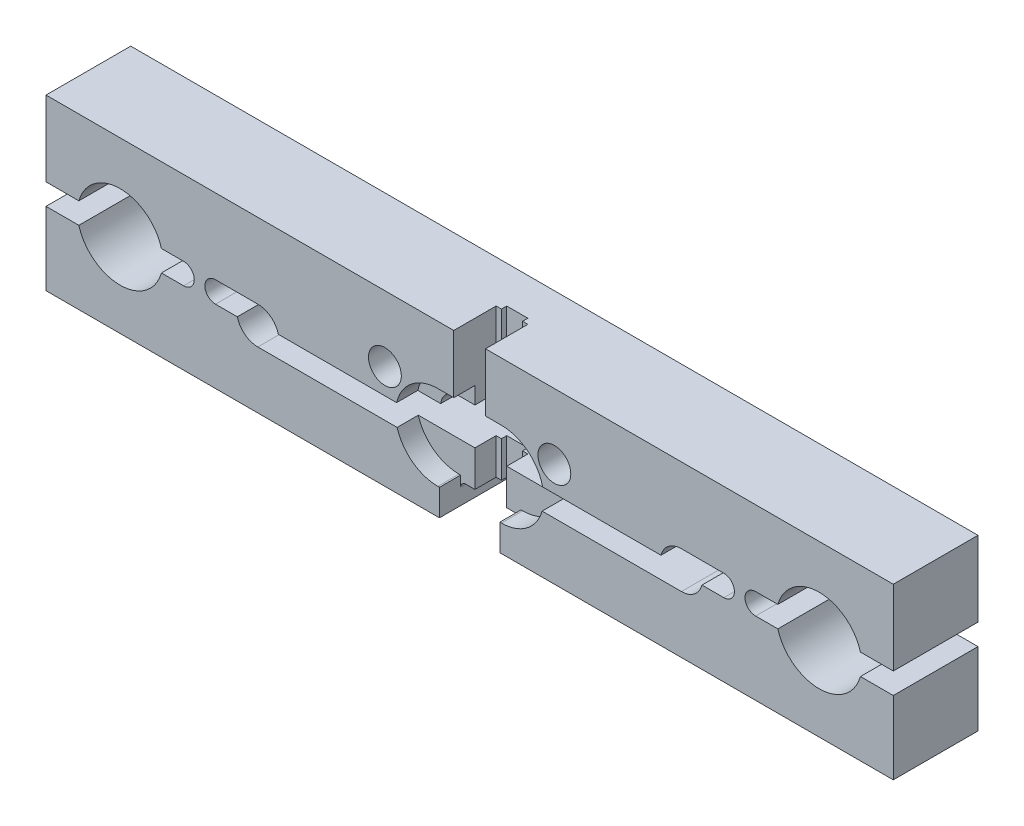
from build123d import *

# Parameters (mm, degrees)
SKETCH_2_W           = 80
SKETCH_2_H           = 16
EXTRUDE_1_DEPTH      = 8
SKETCH_5_R           = 1.55
CUT_EXTRUDE_3_DEPTH  = 82.975606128
CUT_EXTRUDE_4_DEPTH  = 82.975606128
SKETCH_8_W           = 3
SKETCH_8_H           = 16
CUT_EXTRUDE_5_DEPTH  = 4
SKETCH_9_R           = 0.5
CUT_EXTRUDE_6_DEPTH  = 82.975606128
CUT_EXTRUDE_7_DEPTH  = 2
CUT_EXTRUDE_8_DEPTH  = 82.975606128
SKETCH_12_W          = 5.7
SKETCH_12_H          = 2.5
CUT_EXTRUDE_9_DEPTH  = 2
SKETCH_13_W          = 2
SKETCH_13_H          = 14
CUT_EXTRUDE_10_DEPTH = 0.5


with BuildPart() as part:
    # Sketch 2 → Extrude 1 (new body)
    with BuildSketch(Plane.XY):
        with Locations((40, 8)):
            Rectangle(SKETCH_2_W, SKETCH_2_H)
        with BuildLine():
            ThreePointArc((11.048765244, 7.9), (7, 11.85), (2.951234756, 7.9))
            ThreePointArc((2.951234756, 7.9), (7, 3.95), (11.048765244, 7.9))
        make_face(mode=Mode.SUBTRACT)
        with BuildLine():
            ThreePointArc((77.048765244, 7.9), (73, 11.85), (68.951234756, 7.9))
            ThreePointArc((68.951234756, 7.9), (73, 3.95), (77.048765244, 7.9))
        make_face(mode=Mode.SUBTRACT)
    extrude(amount=EXTRUDE_1_DEPTH)

    # Sketch 5 → Cut-Extrude 3 (cut, through all)
    with BuildSketch(Plane.XY.offset(8)):
        with Locations((48, 9.8)):
            Circle(SKETCH_5_R)
        with Locations((32, 9.8)):
            Circle(SKETCH_5_R)
    extrude(amount=-CUT_EXTRUDE_3_DEPTH, mode=Mode.SUBTRACT)

    # Sketch 6 → Cut-Extrude 4 (cut, through all)
    with BuildSketch(Plane.XY.offset(8)):
        with BuildLine():
            Line((3.102244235, 8.9), (0, 8.9))
            Line((0, 8.9), (0, 6.9))
            Line((0, 6.9), (3.102244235, 6.9))
            ThreePointArc((3.102244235, 6.9), (2.995402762, 7.395267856), (2.951234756, 7.9))
            ThreePointArc((2.951234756, 7.9), (2.995402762, 8.404732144), (3.102244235, 8.9))
        make_face()
        with BuildLine():
            ThreePointArc((60, 5.4), (61.224744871, 5.81886117), (61.936491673, 6.9))
            Line((61.936491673, 6.9), (64, 6.9))
            ThreePointArc((64, 6.9), (65, 7.9), (64, 8.9))
            Line((64, 8.9), (60, 8.9))
            ThreePointArc((60, 8.9), (58.775255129, 8.48113883), (58.063508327, 7.4))
            Line((58.063508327, 7.4), (21.936491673, 7.4))
            ThreePointArc((21.936491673, 7.4), (21.224744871, 8.48113883), (20, 8.9))
            Line((20, 8.9), (16, 8.9))
            ThreePointArc((16, 8.9), (15, 7.9), (16, 6.9))
            Line((16, 6.9), (18.063508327, 6.9))
            ThreePointArc((18.063508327, 6.9), (18.775255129, 5.81886117), (20, 5.4))
            Line((20, 5.4), (60, 5.4))
        make_face()
        with BuildLine():
            Line((76.897755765, 6.9), (80, 6.9))
            Line((80, 6.9), (80, 8.9))
            Line((80, 8.9), (76.897755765, 8.9))
            ThreePointArc((76.897755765, 8.9), (77.004597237, 8.404732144), (77.048765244, 7.9))
            ThreePointArc((77.048765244, 7.9), (77.004597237, 7.395267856), (76.897755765, 6.9))
        make_face()
        with BuildLine():
            Line((67, 6.9), (69.102244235, 6.9))
            ThreePointArc((69.102244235, 6.9), (68.995402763, 7.395267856), (68.951234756, 7.9))
            ThreePointArc((68.951234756, 7.9), (68.995402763, 8.404732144), (69.102244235, 8.9))
            Line((69.102244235, 8.9), (67, 8.9))
            ThreePointArc((67, 8.9), (66, 7.9), (67, 6.9))
        make_face()
        with BuildLine():
            Line((13, 8.9), (10.897755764, 8.9))
            ThreePointArc((10.897755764, 8.9), (11.004597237, 8.404732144), (11.048765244, 7.9))
            ThreePointArc((11.048765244, 7.9), (11.004597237, 7.395267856), (10.897755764, 6.9))
            Line((10.897755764, 6.9), (13, 6.9))
            ThreePointArc((13, 6.9), (14, 7.9), (13, 8.9))
        make_face()
    extrude(amount=-CUT_EXTRUDE_4_DEPTH, mode=Mode.SUBTRACT)

    # Sketch 8 → Cut-Extrude 5 (cut)
    with BuildSketch(Plane.XY.offset(8)):
        with Locations((40, 8)):
            Rectangle(SKETCH_8_W, SKETCH_8_H)
    extrude(amount=-CUT_EXTRUDE_5_DEPTH, mode=Mode.SUBTRACT)

    # Sketch 9 → Cut-Extrude 6 (cut, through all)
    with BuildSketch(Plane.XY.offset(8)):
        with Locations((37.65, 1.5)):
            Circle(SKETCH_9_R)
        with Locations((42.35, 1.5)):
            Circle(SKETCH_9_R)
        with BuildLine():
            Line((38.5, 2), (38.5, 0))
            Line((38.5, 0), (42.85, 0))
            Line((42.85, 0), (42.85, 1.5))
            ThreePointArc((42.85, 1.5), (41.996446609, 1.146446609), (42.35, 2))
            Line((42.35, 2), (38.5, 2))
        make_face()
        with BuildLine():
            Line((37.15, 1.5), (37.15, 0))
            Line((37.15, 0), (38.5, 0))
            Line((38.5, 0), (38.5, 2))
            Line((38.5, 2), (37.65, 2))
            ThreePointArc((37.65, 2), (38.003553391, 1.853553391), (38.15, 1.5))
            ThreePointArc((38.15, 1.5), (37.65, 1), (37.15, 1.5))
        make_face()
    extrude(amount=-CUT_EXTRUDE_6_DEPTH, mode=Mode.SUBTRACT)

    # Sketch 10 → Cut-Extrude 7 (cut)
    with BuildSketch(Plane.XY.offset(8)):
        with BuildLine():
            Line((37, 10.5), (43, 10.5))
            ThreePointArc((43, 10.5), (47, 6.5), (43, 2.5))
            Line((43, 2.5), (37, 2.5))
            ThreePointArc((37, 2.5), (33, 6.5), (37, 10.5))
        make_face()
    extrude(amount=-CUT_EXTRUDE_7_DEPTH, mode=Mode.SUBTRACT)

    # Sketch 11 → Cut-Extrude 8 (cut, through all)
    with BuildSketch(Plane.XY.offset(8)):
        with BuildLine():
            Line((37, 5.4), (43, 5.4))
            ThreePointArc((43, 5.4), (44.75, 7.15), (43, 8.9))
            Line((43, 8.9), (37, 8.9))
            ThreePointArc((37, 8.9), (35.25, 7.15), (37, 5.4))
        make_face()
    extrude(amount=-CUT_EXTRUDE_8_DEPTH, mode=Mode.SUBTRACT)

    # Sketch 12 → Cut-Extrude 9 (cut)
    with BuildSketch(Plane.XY.offset(8)):
        with Locations((40, 1.25)):
            Rectangle(SKETCH_12_W, SKETCH_12_H)
    extrude(amount=-CUT_EXTRUDE_9_DEPTH, mode=Mode.SUBTRACT)

    # Sketch 13 → Cut-Extrude 10 (cut)
    with BuildSketch(Plane.XY.offset(4)):
        with Locations((40, 9)):
            Rectangle(SKETCH_13_W, SKETCH_13_H)
    extrude(amount=-CUT_EXTRUDE_10_DEPTH, mode=Mode.SUBTRACT)


solid = part.part
